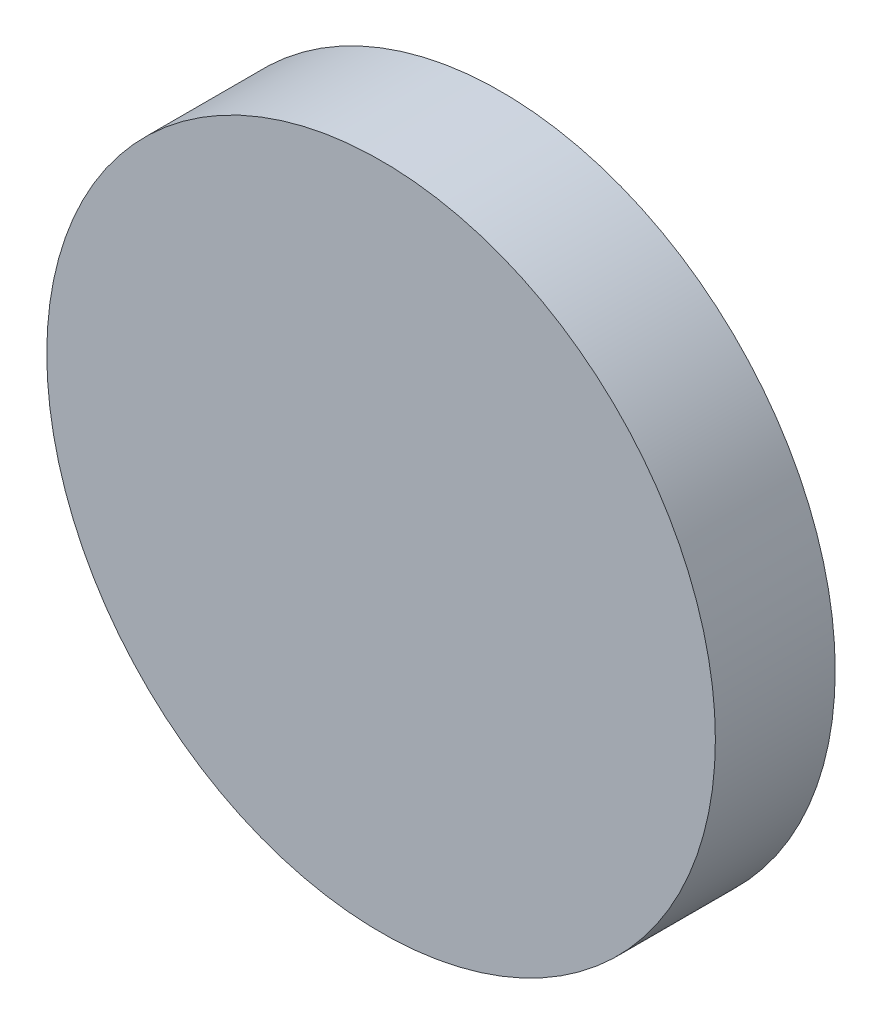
from build123d import *

# Parameters (mm, degrees)
SKETCH1_R           = 5.3
BOSS_EXTRUDE1_DEPTH = 1.9


with BuildPart() as part:
    # Sketch1 → Boss-Extrude1 (new body)
    with BuildSketch(Plane.XY):
        with Locations(Location((0, 0, 0), (0, 0, 180))):
            Circle(SKETCH1_R)
    extrude(amount=BOSS_EXTRUDE1_DEPTH)


solid = part.part
